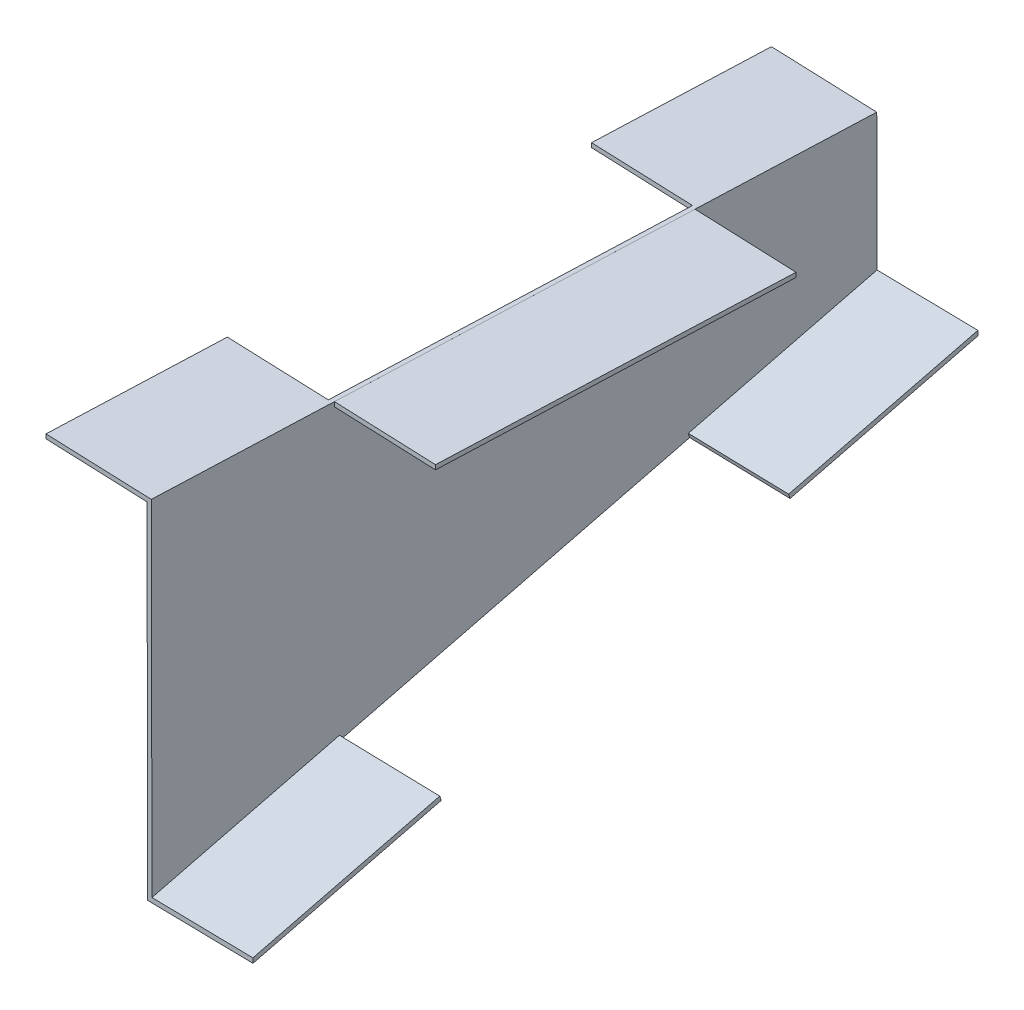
ISO-10303-21;
HEADER;
FILE_DESCRIPTION(('STEP AP214'),'2;1');
FILE_NAME('part.step','',(''),(''),'','','');
FILE_SCHEMA(('AUTOMOTIVE_DESIGN { 1 0 10303 214 1 1 1 1 }'));
ENDSEC;
DATA;
#1=APPLICATION_CONTEXT('core data for automotive mechanical design processes');
#2=APPLICATION_PROTOCOL_DEFINITION('international standard','automotive_design',2000,#1);
#3=PRODUCT_CONTEXT('',#1,'mechanical');
#4=PRODUCT('Part','Part','',(#3));
#5=PRODUCT_RELATED_PRODUCT_CATEGORY('part','',(#4));
#6=PRODUCT_DEFINITION_FORMATION('','',#4);
#7=PRODUCT_DEFINITION_CONTEXT('part definition',#1,'design');
#8=PRODUCT_DEFINITION('design','',#6,#7);
#9=PRODUCT_DEFINITION_SHAPE('','',#8);
#10=(LENGTH_UNIT() NAMED_UNIT(*) SI_UNIT(.MILLI.,.METRE.));
#11=(NAMED_UNIT(*) PLANE_ANGLE_UNIT() SI_UNIT($,.RADIAN.));
#12=(NAMED_UNIT(*) SI_UNIT($,.STERADIAN.) SOLID_ANGLE_UNIT());
#13=UNCERTAINTY_MEASURE_WITH_UNIT(LENGTH_MEASURE(1.E-05),#10,'distance_accuracy_value','');
#14=(GEOMETRIC_REPRESENTATION_CONTEXT(3) GLOBAL_UNCERTAINTY_ASSIGNED_CONTEXT((#13)) GLOBAL_UNIT_ASSIGNED_CONTEXT((#10,
#11,#12)) REPRESENTATION_CONTEXT('',''));
#15=CARTESIAN_POINT('',(0.,0.,0.));
#16=DIRECTION('',(0.,0.,1.));
#17=DIRECTION('',(1.,0.,0.));
#18=AXIS2_PLACEMENT_3D('',#15,#16,#17);
#19=CARTESIAN_POINT('',(44.8063063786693,0.0880080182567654,-1141.75285614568));
#20=DIRECTION('',(0.0392132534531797,7.70222097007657E-05,-0.999230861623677));
#21=DIRECTION('',(-0.999230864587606,0.,-0.0392132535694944));
#22=AXIS2_PLACEMENT_3D('',#19,#20,#21);
#23=PLANE('',#22);
#24=DIRECTION('',(0.9989905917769,0.0219254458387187,0.0392055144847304));
#25=VECTOR('',#24,1.);
#26=CARTESIAN_POINT('',(45.9267992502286,-51.0366664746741,-1141.71282492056));
#27=LINE('',#26,#25);
#28=CARTESIAN_POINT('',(-32.9736635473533,-52.7683422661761,-1144.80928374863));
#29=VERTEX_POINT('',#28);
#30=CARTESIAN_POINT('',(5.08849497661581,-51.9329692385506,-1143.31552943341));
#31=VERTEX_POINT('',#30);
#32=EDGE_CURVE('E932',#29,#31,#27,.T.);
#33=ORIENTED_EDGE('',*,*,#32,.F.);
#34=DIRECTION('',(-0.00196418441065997,0.99999807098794,0.));
#35=VECTOR('',#34,1.);
#36=CARTESIAN_POINT('',(-33.0771828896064,-0.0649698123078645,-1144.80928374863));
#37=LINE('',#36,#35);
#38=CARTESIAN_POINT('',(-32.9736316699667,-52.7845715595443,-1144.80928374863));
#39=VERTEX_POINT('',#38);
#40=EDGE_CURVE('E540',#39,#29,#37,.T.);
#41=ORIENTED_EDGE('',*,*,#40,.F.);
#42=DIRECTION('',(0.999228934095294,0.0019626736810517,0.0392133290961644));
#43=VECTOR('',#42,1.);
#44=CARTESIAN_POINT('',(44.909857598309,-52.6315937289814,-1141.75285614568));
#45=LINE('',#44,#43);
#46=CARTESIAN_POINT('',(-34.597978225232,-52.7877620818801,-1144.8730289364));
#47=VERTEX_POINT('',#46);
#48=EDGE_CURVE('E925',#47,#39,#45,.T.);
#49=ORIENTED_EDGE('',*,*,#48,.F.);
#50=DIRECTION('',(-0.00196418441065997,0.99999807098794,0.));
#51=VECTOR('',#50,1.);
#52=CARTESIAN_POINT('',(-34.7015294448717,-0.0681603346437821,-1144.8730289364));
#53=LINE('',#52,#51);
#54=CARTESIAN_POINT('',(-34.6952773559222,-3.25119999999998,-1144.8730289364));
#55=VERTEX_POINT('',#54);
#56=EDGE_CURVE('E547',#47,#55,#53,.T.);
#57=ORIENTED_EDGE('',*,*,#56,.T.);
#58=DIRECTION('',(0.999230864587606,0.,0.0392132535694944));
#59=VECTOR('',#58,1.);
#60=CARTESIAN_POINT('',(44.8063164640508,-3.25119999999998,-1141.75311314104));
#61=LINE('',#60,#59);
#62=CARTESIAN_POINT('',(-72.769161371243,-3.25119999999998,-1146.3671790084));
#63=VERTEX_POINT('',#62);
#64=EDGE_CURVE('E921',#63,#55,#61,.T.);
#65=ORIENTED_EDGE('',*,*,#64,.F.);
#66=DIRECTION('',(3.02030307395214E-06,-0.99999999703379,-7.69629687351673E-05));
#67=VECTOR('',#66,1.);
#68=CARTESIAN_POINT('',(-72.7691662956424,-1.6207677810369,-1146.3670535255));
#69=LINE('',#68,#67);
#70=CARTESIAN_POINT('',(-72.7691660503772,-1.70197327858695,-1146.36705977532));
#71=VERTEX_POINT('',#70);
#72=EDGE_CURVE('E919',#71,#63,#69,.T.);
#73=ORIENTED_EDGE('',*,*,#72,.F.);
#74=DIRECTION('',(-0.999228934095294,-0.00196267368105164,-0.0392133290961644));
#75=VECTOR('',#74,1.);
#76=CARTESIAN_POINT('',(44.8093686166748,-1.47102690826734,-1141.75285614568));
#77=LINE('',#76,#75);
#78=CARTESIAN_POINT('',(-33.0741206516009,-1.62400473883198,-1144.80928374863));
#79=VERTEX_POINT('',#78);
#80=EDGE_CURVE('E539',#79,#71,#77,.T.);
#81=ORIENTED_EDGE('',*,*,#80,.F.);
#82=CARTESIAN_POINT('',(-32.9769955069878,-51.0719876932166,-1144.80928374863));
#83=VERTEX_POINT('',#82);
#84=EDGE_CURVE('E524',#83,#79,#37,.T.);
#85=ORIENTED_EDGE('',*,*,#84,.F.);
#86=DIRECTION('',(0.9989905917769,0.0219254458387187,0.0392055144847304));
#87=VECTOR('',#86,1.);
#88=CARTESIAN_POINT('',(45.8896367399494,-49.3410544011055,-1141.71415260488));
#89=LINE('',#88,#87);
#90=CARTESIAN_POINT('',(5.05408347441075,-50.2372967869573,-1143.31674915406));
#91=VERTEX_POINT('',#90);
#92=EDGE_CURVE('E537',#83,#91,#89,.T.);
#93=ORIENTED_EDGE('',*,*,#92,.T.);
#94=DIRECTION('',(0.0202895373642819,-0.999793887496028,0.000719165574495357));
#95=VECTOR('',#94,1.);
#96=CARTESIAN_POINT('',(5.0851502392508,-51.7681528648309,-1143.3156479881));
#97=LINE('',#96,#95);
#98=EDGE_CURVE('E545',#91,#31,#97,.T.);
#99=ORIENTED_EDGE('',*,*,#98,.T.);
#100=EDGE_LOOP('',(#33,#41,#49,#57,#65,#73,#81,#85,#93,#99));
#101=FACE_BOUND('',#100,.T.);
#102=ADVANCED_FACE('F343',(#101),#23,.T.);
#103=CARTESIAN_POINT('',(-2.41879427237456,-1.62559999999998,-954.357699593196));
#104=DIRECTION('',(-0.999230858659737,0.,-0.0392134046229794));
#105=DIRECTION('',(-0.0392134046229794,0.,0.999230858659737));
#106=AXIS2_PLACEMENT_3D('',#103,#104,#105);
#107=PLANE('',#106);
#108=DIRECTION('',(0.0392134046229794,0.,-0.999230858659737));
#109=VECTOR('',#108,1.);
#110=CARTESIAN_POINT('',(-2.41879427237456,-3.25119999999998,-954.357699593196));
#111=LINE('',#110,#109);
#112=CARTESIAN_POINT('',(-2.41879427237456,-3.25119999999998,-954.357699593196));
#113=VERTEX_POINT('',#112);
#114=CARTESIAN_POINT('',(2.51150709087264,-3.25119999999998,-1079.99099545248));
#115=VERTEX_POINT('',#114);
#116=EDGE_CURVE('E784',#113,#115,#111,.T.);
#117=ORIENTED_EDGE('',*,*,#116,.T.);
#118=DIRECTION('',(0.,-1.,0.));
#119=VECTOR('',#118,1.);
#120=CARTESIAN_POINT('',(2.51150709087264,-1.62559999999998,-1079.99099545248));
#121=LINE('',#120,#119);
#122=CARTESIAN_POINT('',(2.51150709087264,-1.62559999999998,-1079.99099545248));
#123=VERTEX_POINT('',#122);
#124=EDGE_CURVE('E785',#123,#115,#121,.T.);
#125=ORIENTED_EDGE('',*,*,#124,.F.);
#126=DIRECTION('',(0.0392134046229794,0.,-0.999230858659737));
#127=VECTOR('',#126,1.);
#128=CARTESIAN_POINT('',(-2.41879427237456,-1.62559999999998,-954.357699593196));
#129=LINE('',#128,#127);
#130=CARTESIAN_POINT('',(-2.41879427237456,-1.62559999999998,-954.357699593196));
#131=VERTEX_POINT('',#130);
#132=EDGE_CURVE('E792',#131,#123,#129,.T.);
#133=ORIENTED_EDGE('',*,*,#132,.F.);
#134=DIRECTION('',(0.,-1.,0.));
#135=VECTOR('',#134,1.);
#136=CARTESIAN_POINT('',(-2.41879427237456,-1.62559999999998,-954.357699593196));
#137=LINE('',#136,#135);
#138=EDGE_CURVE('E588',#131,#113,#137,.T.);
#139=ORIENTED_EDGE('',*,*,#138,.T.);
#140=EDGE_LOOP('',(#117,#125,#133,#139));
#141=FACE_BOUND('',#140,.T.);
#142=ADVANCED_FACE('F810',(#141),#107,.F.);
#143=CARTESIAN_POINT('',(-4.70180762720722,-127.371296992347,-890.064538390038));
#144=DIRECTION('',(-0.998795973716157,-0.0203014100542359,-0.0446593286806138));
#145=DIRECTION('',(-0.044668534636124,0.,0.999001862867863));
#146=AXIS2_PLACEMENT_3D('',#143,#144,#145);
#147=PLANE('',#146);
#148=DIRECTION('',(-0.0202895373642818,0.999793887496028,-0.000719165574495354));
#149=VECTOR('',#148,1.);
#150=CARTESIAN_POINT('',(-4.68117552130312,-127.371210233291,-890.526010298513));
#151=LINE('',#150,#149);
#152=CARTESIAN_POINT('',(-4.68396399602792,-127.233804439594,-890.526109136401));
#153=VERTEX_POINT('',#152);
#154=CARTESIAN_POINT('',(-4.71837549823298,-125.538131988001,-890.527328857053));
#155=VERTEX_POINT('',#154);
#156=EDGE_CURVE('E685',#153,#155,#151,.T.);
#157=ORIENTED_EDGE('',*,*,#156,.F.);
#158=DIRECTION('',(-0.0370242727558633,-0.285287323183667,0.95772665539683));
#159=VECTOR('',#158,1.);
#160=CARTESIAN_POINT('',(-4.70180762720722,-127.371296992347,-890.064538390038));
#161=LINE('',#160,#159);
#162=CARTESIAN_POINT('',(-2.146996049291,-107.6854179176,-956.151215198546));
#163=VERTEX_POINT('',#162);
#164=EDGE_CURVE('E730',#163,#153,#161,.T.);
#165=ORIENTED_EDGE('',*,*,#164,.F.);
#166=DIRECTION('',(-0.0321839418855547,0.95822700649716,0.28419218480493));
#167=VECTOR('',#166,1.);
#168=CARTESIAN_POINT('',(-2.146996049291,-107.6854179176,-956.151215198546));
#169=LINE('',#168,#167);
#170=CARTESIAN_POINT('',(-2.19931426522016,-106.127724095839,-955.689232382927));
#171=VERTEX_POINT('',#170);
#172=EDGE_CURVE('E732',#163,#171,#169,.T.);
#173=ORIENTED_EDGE('',*,*,#172,.T.);
#174=DIRECTION('',(-0.0370242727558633,-0.285287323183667,0.95772665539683));
#175=VECTOR('',#174,1.);
#176=CARTESIAN_POINT('',(-4.75412584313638,-125.813603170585,-889.602555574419));
#177=LINE('',#176,#175);
#178=EDGE_CURVE('E729',#171,#155,#177,.T.);
#179=ORIENTED_EDGE('',*,*,#178,.T.);
#180=EDGE_LOOP('',(#157,#165,#173,#179));
#181=FACE_BOUND('',#180,.T.);
#182=ADVANCED_FACE('F833',(#181),#147,.F.);
#183=CARTESIAN_POINT('',(-75.2241274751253,-73.3962182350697,-1080.04183992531));
#184=DIRECTION('',(0.998795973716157,0.0203014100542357,0.0446593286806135));
#185=DIRECTION('',(0.0446685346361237,0.,-0.999001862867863));
#186=AXIS2_PLACEMENT_3D('',#183,#184,#185);
#187=PLANE('',#186);
#188=DIRECTION('',(0.037024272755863,0.285287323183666,-0.95772665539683));
#189=VECTOR('',#188,1.);
#190=CARTESIAN_POINT('',(-75.2480951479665,-72.6826179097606,-1079.83019943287));
#191=LINE('',#190,#189);
#192=CARTESIAN_POINT('',(-79.8561361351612,-108.1894781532,-960.631539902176));
#193=VERTEX_POINT('',#192);
#194=CARTESIAN_POINT('',(-75.2480951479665,-72.6826179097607,-1079.83019943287));
#195=VERTEX_POINT('',#194);
#196=EDGE_CURVE('E575',#193,#195,#191,.T.);
#197=ORIENTED_EDGE('',*,*,#196,.F.);
#198=DIRECTION('',(-0.0321839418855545,0.95822700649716,0.284192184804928));
#199=VECTOR('',#198,1.);
#200=CARTESIAN_POINT('',(-79.8321684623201,-108.903078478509,-960.843180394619));
#201=LINE('',#200,#199);
#202=CARTESIAN_POINT('',(-79.8844866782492,-107.345384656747,-960.381197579));
#203=VERTEX_POINT('',#202);
#204=EDGE_CURVE('E587',#193,#203,#201,.T.);
#205=ORIENTED_EDGE('',*,*,#204,.T.);
#206=DIRECTION('',(0.037024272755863,0.285287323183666,-0.95772665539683));
#207=VECTOR('',#206,1.);
#208=CARTESIAN_POINT('',(-75.2764456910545,-71.8385244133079,-1079.57985710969));
#209=LINE('',#208,#207);
#210=CARTESIAN_POINT('',(-75.2764456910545,-71.8385244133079,-1079.57985710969));
#211=VERTEX_POINT('',#210);
#212=EDGE_CURVE('E595',#203,#211,#209,.T.);
#213=ORIENTED_EDGE('',*,*,#212,.T.);
#214=DIRECTION('',(-0.0321839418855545,0.95822700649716,0.284192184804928));
#215=VECTOR('',#214,1.);
#216=CARTESIAN_POINT('',(-75.2241274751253,-73.3962182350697,-1080.04183992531));
#217=LINE('',#216,#215);
#218=EDGE_CURVE('E598',#195,#211,#217,.T.);
#219=ORIENTED_EDGE('',*,*,#218,.F.);
#220=EDGE_LOOP('',(#197,#205,#213,#219));
#221=FACE_BOUND('',#220,.T.);
#222=ADVANCED_FACE('F840',(#221),#187,.F.);
#223=CARTESIAN_POINT('',(12.0641081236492,-359.190128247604,-106.529065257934));
#224=DIRECTION('',(0.0321839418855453,-0.95822700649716,-0.284192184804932));
#225=DIRECTION('',(0.,0.284339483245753,-0.958723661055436));
#226=AXIS2_PLACEMENT_3D('',#223,#224,#225);
#227=PLANE('',#226);
#228=ORIENTED_EDGE('',*,*,#164,.T.);
#229=DIRECTION('',(-0.9989905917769,-0.0219254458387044,-0.0392055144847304));
#230=VECTOR('',#229,1.);
#231=CARTESIAN_POINT('',(37.6556829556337,-126.304550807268,-888.864484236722));
#232=LINE('',#231,#230);
#233=CARTESIAN_POINT('',(-42.746122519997,-128.069177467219,-892.019863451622));
#234=VERTEX_POINT('',#233);
#235=EDGE_CURVE('E692',#153,#234,#232,.T.);
#236=ORIENTED_EDGE('',*,*,#235,.T.);
#237=DIRECTION('',(0.0370242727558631,0.285287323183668,-0.957726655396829));
#238=VECTOR('',#237,1.);
#239=CARTESIAN_POINT('',(-72.9650393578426,-360.918420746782,-110.330987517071));
#240=LINE('',#239,#238);
#241=CARTESIAN_POINT('',(-40.2011226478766,-108.458901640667,-957.852735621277));
#242=VERTEX_POINT('',#241);
#243=EDGE_CURVE('E646',#234,#242,#240,.T.);
#244=ORIENTED_EDGE('',*,*,#243,.T.);
#245=DIRECTION('',(0.998795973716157,0.0203014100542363,0.0446593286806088));
#246=VECTOR('',#245,1.);
#247=CARTESIAN_POINT('',(-2.146996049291,-107.6854179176,-956.151215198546));
#248=LINE('',#247,#246);
#249=EDGE_CURVE('E554',#242,#163,#248,.T.);
#250=ORIENTED_EDGE('',*,*,#249,.T.);
#251=EDGE_LOOP('',(#228,#236,#244,#250));
#252=FACE_BOUND('',#251,.T.);
#253=ADVANCED_FACE('F853',(#252),#227,.T.);
#254=CARTESIAN_POINT('',(-2.146996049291,-107.6854179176,-956.151215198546));
#255=DIRECTION('',(-0.0370242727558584,-0.285287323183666,0.95772665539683));
#256=DIRECTION('',(0.,-0.958383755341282,-0.285483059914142));
#257=AXIS2_PLACEMENT_3D('',#254,#255,#256);
#258=PLANE('',#257);
#259=DIRECTION('',(0.0130667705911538,-0.958440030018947,-0.284994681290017));
#260=VECTOR('',#259,1.);
#261=CARTESIAN_POINT('',(-45.1195725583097,252.30654127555,-850.578175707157));
#262=LINE('',#261,#260);
#263=CARTESIAN_POINT('',(-40.2223678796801,-106.900576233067,-957.389363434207));
#264=VERTEX_POINT('',#263);
#265=EDGE_CURVE('E531',#264,#242,#262,.T.);
#266=ORIENTED_EDGE('',*,*,#265,.F.);
#267=DIRECTION('',(0.998795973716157,0.0203014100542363,0.0446593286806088));
#268=VECTOR('',#267,1.);
#269=CARTESIAN_POINT('',(-2.19931426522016,-106.127724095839,-955.689232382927));
#270=LINE('',#269,#268);
#271=EDGE_CURVE('E640',#264,#171,#270,.T.);
#272=ORIENTED_EDGE('',*,*,#271,.T.);
#273=ORIENTED_EDGE('',*,*,#172,.F.);
#274=ORIENTED_EDGE('',*,*,#249,.F.);
#275=EDGE_LOOP('',(#266,#272,#273,#274));
#276=FACE_BOUND('',#275,.T.);
#277=ADVANCED_FACE('F724',(#276),#258,.F.);
#278=CARTESIAN_POINT('',(12.01178990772,-357.632434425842,-106.067082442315));
#279=DIRECTION('',(0.0321839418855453,-0.95822700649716,-0.284192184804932));
#280=DIRECTION('',(0.,0.284339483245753,-0.958723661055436));
#281=AXIS2_PLACEMENT_3D('',#278,#279,#280);
#282=PLANE('',#281);
#283=DIRECTION('',(-0.9989905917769,-0.0219254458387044,-0.0392055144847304));
#284=VECTOR('',#283,1.);
#285=CARTESIAN_POINT('',(37.6185204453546,-124.608938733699,-888.865811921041));
#286=LINE('',#285,#284);
#287=CARTESIAN_POINT('',(-42.7494544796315,-126.37282289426,-892.019863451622));
#288=VERTEX_POINT('',#287);
#289=EDGE_CURVE('E352',#155,#288,#286,.T.);
#290=ORIENTED_EDGE('',*,*,#289,.F.);
#291=ORIENTED_EDGE('',*,*,#178,.F.);
#292=ORIENTED_EDGE('',*,*,#271,.F.);
#293=DIRECTION('',(0.0370242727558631,0.285287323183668,-0.957726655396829));
#294=VECTOR('',#293,1.);
#295=CARTESIAN_POINT('',(-72.9862845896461,-359.360095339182,-109.867615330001));
#296=LINE('',#295,#294);
#297=EDGE_CURVE('E651',#288,#264,#296,.T.);
#298=ORIENTED_EDGE('',*,*,#297,.F.);
#299=EDGE_LOOP('',(#290,#291,#292,#298));
#300=FACE_BOUND('',#299,.T.);
#301=ADVANCED_FACE('F728',(#300),#282,.F.);
#302=CARTESIAN_POINT('',(-35.5591886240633,-1.62559999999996,-1081.48502616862));
#303=DIRECTION('',(-0.0392134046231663,0.,0.999230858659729));
#304=DIRECTION('',(0.999230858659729,0.,0.0392134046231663));
#305=AXIS2_PLACEMENT_3D('',#302,#303,#304);
#306=PLANE('',#305);
#307=DIRECTION('',(0.001961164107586,-0.999998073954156,7.69631171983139E-05));
#308=VECTOR('',#307,1.);
#309=CARTESIAN_POINT('',(-35.5620766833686,-0.152977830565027,-1081.48513950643));
#310=LINE('',#309,#308);
#311=CARTESIAN_POINT('',(-35.5591886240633,-1.62559999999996,-1081.48502616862));
#312=VERTEX_POINT('',#311);
#313=CARTESIAN_POINT('',(-35.5560005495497,-3.25119999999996,-1081.48490105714));
#314=VERTEX_POINT('',#313);
#315=EDGE_CURVE('E768',#312,#314,#310,.T.);
#316=ORIENTED_EDGE('',*,*,#315,.F.);
#317=DIRECTION('',(-0.999230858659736,0.,-0.0392134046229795));
#318=VECTOR('',#317,1.);
#319=CARTESIAN_POINT('',(2.51150709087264,-1.62559999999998,-1079.99099545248));
#320=LINE('',#319,#318);
#321=EDGE_CURVE('E781',#123,#312,#320,.T.);
#322=ORIENTED_EDGE('',*,*,#321,.F.);
#323=ORIENTED_EDGE('',*,*,#124,.T.);
#324=DIRECTION('',(-0.999230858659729,0.,-0.0392134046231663));
#325=VECTOR('',#324,1.);
#326=CARTESIAN_POINT('',(-35.5591886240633,-3.25119999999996,-1081.48502616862));
#327=LINE('',#326,#325);
#328=EDGE_CURVE('E774',#115,#314,#327,.T.);
#329=ORIENTED_EDGE('',*,*,#328,.T.);
#330=EDGE_LOOP('',(#316,#322,#323,#329));
#331=FACE_BOUND('',#330,.T.);
#332=ADVANCED_FACE('F808',(#331),#306,.F.);
#333=CARTESIAN_POINT('',(0.,-1.62559999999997,0.));
#334=DIRECTION('',(0.,-1.,0.));
#335=DIRECTION('',(0.,0.,-1.));
#336=AXIS2_PLACEMENT_3D('',#333,#334,#335);
#337=PLANE('',#336);
#338=DIRECTION('',(0.0392134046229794,0.,-0.999230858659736));
#339=VECTOR('',#338,1.);
#340=CARTESIAN_POINT('',(-77.8806012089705,-1.62559999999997,-3.05631426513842));
#341=LINE('',#340,#339);
#342=CARTESIAN_POINT('',(-40.4894899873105,-1.62559999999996,-955.851730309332));
#343=VERTEX_POINT('',#342);
#344=EDGE_CURVE('E758',#343,#312,#341,.T.);
#345=ORIENTED_EDGE('',*,*,#344,.F.);
#346=DIRECTION('',(0.999230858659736,0.,0.0392134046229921));
#347=VECTOR('',#346,1.);
#348=CARTESIAN_POINT('',(-41.7585131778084,-1.62559999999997,-955.901531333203));
#349=LINE('',#348,#347);
#350=EDGE_CURVE('E772',#343,#131,#349,.T.);
#351=ORIENTED_EDGE('',*,*,#350,.T.);
#352=ORIENTED_EDGE('',*,*,#132,.T.);
#353=ORIENTED_EDGE('',*,*,#321,.T.);
#354=EDGE_LOOP('',(#345,#351,#352,#353));
#355=FACE_BOUND('',#354,.T.);
#356=ADVANCED_FACE('F820',(#355),#337,.F.);
#357=CARTESIAN_POINT('',(-2.41879427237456,-1.62559999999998,-954.357699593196));
#358=DIRECTION('',(0.0392134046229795,0.,-0.999230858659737));
#359=DIRECTION('',(-0.999230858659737,0.,-0.0392134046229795));
#360=AXIS2_PLACEMENT_3D('',#357,#358,#359);
#361=PLANE('',#360);
#362=DIRECTION('',(-0.00196116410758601,0.999998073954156,-7.69631171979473E-05));
#363=VECTOR('',#362,1.);
#364=CARTESIAN_POINT('',(-40.4923780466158,-0.152977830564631,-955.851843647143));
#365=LINE('',#364,#363);
#366=CARTESIAN_POINT('',(-40.4863019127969,-3.25119999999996,-955.851605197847));
#367=VERTEX_POINT('',#366);
#368=EDGE_CURVE('E763',#367,#343,#365,.T.);
#369=ORIENTED_EDGE('',*,*,#368,.F.);
#370=DIRECTION('',(0.999230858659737,0.,0.0392134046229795));
#371=VECTOR('',#370,1.);
#372=CARTESIAN_POINT('',(-2.41879427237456,-3.25119999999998,-954.357699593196));
#373=LINE('',#372,#371);
#374=EDGE_CURVE('E586',#367,#113,#373,.T.);
#375=ORIENTED_EDGE('',*,*,#374,.T.);
#376=ORIENTED_EDGE('',*,*,#138,.F.);
#377=ORIENTED_EDGE('',*,*,#350,.F.);
#378=EDGE_LOOP('',(#369,#375,#376,#377));
#379=FACE_BOUND('',#378,.T.);
#380=ADVANCED_FACE('F819',(#379),#361,.F.);
#381=CARTESIAN_POINT('',(0.,-3.25119999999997,0.));
#382=DIRECTION('',(0.,-1.,0.));
#383=DIRECTION('',(0.,0.,-1.));
#384=AXIS2_PLACEMENT_3D('',#381,#382,#383);
#385=PLANE('',#384);
#386=ORIENTED_EDGE('',*,*,#374,.F.);
#387=DIRECTION('',(0.0392134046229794,0.,-0.999230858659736));
#388=VECTOR('',#387,1.);
#389=CARTESIAN_POINT('',(-77.8774131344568,-3.25119999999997,-3.05618915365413));
#390=LINE('',#389,#388);
#391=EDGE_CURVE('E647',#367,#314,#390,.T.);
#392=ORIENTED_EDGE('',*,*,#391,.T.);
#393=ORIENTED_EDGE('',*,*,#328,.F.);
#394=ORIENTED_EDGE('',*,*,#116,.F.);
#395=EDGE_LOOP('',(#386,#392,#393,#394));
#396=FACE_BOUND('',#395,.T.);
#397=ADVANCED_FACE('F816',(#396),#385,.T.);
#398=CARTESIAN_POINT('',(-82.6994902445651,-1.62559999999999,-893.323834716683));
#399=DIRECTION('',(-0.999230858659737,0.,-0.0392134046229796));
#400=DIRECTION('',(-0.0392134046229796,0.,0.999230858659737));
#401=AXIS2_PLACEMENT_3D('',#398,#399,#400);
#402=PLANE('',#401);
#403=DIRECTION('',(0.0392134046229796,0.,-0.999230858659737));
#404=VECTOR('',#403,1.);
#405=CARTESIAN_POINT('',(-82.6994902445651,-3.25119999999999,-893.323834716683));
#406=LINE('',#405,#404);
#407=CARTESIAN_POINT('',(-82.6895253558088,-3.25119999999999,-893.577758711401));
#408=VERTEX_POINT('',#407);
#409=CARTESIAN_POINT('',(-80.2094390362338,-3.25119999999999,-956.774994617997));
#410=VERTEX_POINT('',#409);
#411=EDGE_CURVE('E605',#408,#410,#406,.T.);
#412=ORIENTED_EDGE('',*,*,#411,.F.);
#413=DIRECTION('',(-3.02030307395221E-06,0.99999999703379,7.69629687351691E-05));
#414=VECTOR('',#413,1.);
#415=CARTESIAN_POINT('',(-82.6895302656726,-1.62558043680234,-893.577633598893));
#416=LINE('',#415,#414);
#417=CARTESIAN_POINT('',(-82.6895300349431,-1.70197327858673,-893.577639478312));
#418=VERTEX_POINT('',#417);
#419=EDGE_CURVE('E690',#408,#418,#416,.T.);
#420=ORIENTED_EDGE('',*,*,#419,.T.);
#421=DIRECTION('',(0.0392134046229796,0.,-0.999230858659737));
#422=VECTOR('',#421,1.);
#423=CARTESIAN_POINT('',(-82.6994902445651,-1.70197327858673,-893.323834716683));
#424=LINE('',#423,#422);
#425=CARTESIAN_POINT('',(-80.2094390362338,-1.70197327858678,-956.774994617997));
#426=VERTEX_POINT('',#425);
#427=EDGE_CURVE('E626',#418,#426,#424,.T.);
#428=ORIENTED_EDGE('',*,*,#427,.T.);
#429=DIRECTION('',(0.,-1.,0.));
#430=VECTOR('',#429,1.);
#431=CARTESIAN_POINT('',(-80.2094390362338,-1.62559999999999,-956.774994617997));
#432=LINE('',#431,#430);
#433=EDGE_CURVE('E601',#426,#410,#432,.T.);
#434=ORIENTED_EDGE('',*,*,#433,.T.);
#435=EDGE_LOOP('',(#412,#420,#428,#434));
#436=FACE_BOUND('',#435,.T.);
#437=ADVANCED_FACE('F850',(#436),#402,.T.);
#438=CARTESIAN_POINT('',(-35.499040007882,-72.2274115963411,-1079.48402085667));
#439=DIRECTION('',(0.0370242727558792,0.285287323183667,-0.957726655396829));
#440=DIRECTION('',(0.,0.958383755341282,0.285483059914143));
#441=AXIS2_PLACEMENT_3D('',#438,#439,#440);
#442=PLANE('',#441);
#443=DIRECTION('',(-0.0130667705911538,0.958440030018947,0.284994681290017));
#444=VECTOR('',#443,1.);
#445=CARTESIAN_POINT('',(-40.4174899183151,288.538031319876,-972.209460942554));
#446=LINE('',#445,#444);
#447=CARTESIAN_POINT('',(-35.499040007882,-72.2274115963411,-1079.48402085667));
#448=VERTEX_POINT('',#447);
#449=CARTESIAN_POINT('',(-35.5202852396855,-70.669086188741,-1079.0206486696));
#450=VERTEX_POINT('',#449);
#451=EDGE_CURVE('E527',#448,#450,#446,.T.);
#452=ORIENTED_EDGE('',*,*,#451,.F.);
#453=DIRECTION('',(-0.998795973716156,-0.0203014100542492,-0.0446593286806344));
#454=VECTOR('',#453,1.);
#455=CARTESIAN_POINT('',(-35.499040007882,-72.2274115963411,-1079.48402085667));
#456=LINE('',#455,#454);
#457=CARTESIAN_POINT('',(2.55508659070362,-71.4539278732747,-1077.78250043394));
#458=VERTEX_POINT('',#457);
#459=EDGE_CURVE('E751',#458,#448,#456,.T.);
#460=ORIENTED_EDGE('',*,*,#459,.F.);
#461=DIRECTION('',(-0.0321839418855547,0.95822700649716,0.28419218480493));
#462=VECTOR('',#461,1.);
#463=CARTESIAN_POINT('',(2.55508659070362,-71.4539278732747,-1077.78250043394));
#464=LINE('',#463,#462);
#465=CARTESIAN_POINT('',(2.50276837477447,-69.8962340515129,-1077.32051761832));
#466=VERTEX_POINT('',#465);
#467=EDGE_CURVE('E741',#458,#466,#464,.T.);
#468=ORIENTED_EDGE('',*,*,#467,.T.);
#469=DIRECTION('',(-0.998795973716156,-0.0203014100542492,-0.0446593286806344));
#470=VECTOR('',#469,1.);
#471=CARTESIAN_POINT('',(-35.5513582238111,-70.6697177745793,-1079.02203804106));
#472=LINE('',#471,#470);
#473=EDGE_CURVE('E755',#466,#450,#472,.T.);
#474=ORIENTED_EDGE('',*,*,#473,.T.);
#475=EDGE_LOOP('',(#452,#460,#468,#474));
#476=FACE_BOUND('',#475,.T.);
#477=ADVANCED_FACE('F854',(#476),#442,.F.);
#478=CARTESIAN_POINT('',(5.10989816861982,-51.7680487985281,-1143.86917724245));
#479=DIRECTION('',(-0.998795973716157,-0.0203014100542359,-0.0446593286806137));
#480=DIRECTION('',(-0.0446685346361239,0.,0.999001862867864));
#481=AXIS2_PLACEMENT_3D('',#478,#479,#480);
#482=PLANE('',#481);
#483=ORIENTED_EDGE('',*,*,#98,.F.);
#484=DIRECTION('',(-0.0370242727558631,-0.285287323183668,0.957726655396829));
#485=VECTOR('',#484,1.);
#486=CARTESIAN_POINT('',(5.05757995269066,-50.2103549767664,-1143.40719442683));
#487=LINE('',#486,#485);
#488=EDGE_CURVE('E543',#91,#466,#487,.T.);
#489=ORIENTED_EDGE('',*,*,#488,.T.);
#490=ORIENTED_EDGE('',*,*,#467,.F.);
#491=DIRECTION('',(-0.0370242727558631,-0.285287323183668,0.957726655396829));
#492=VECTOR('',#491,1.);
#493=CARTESIAN_POINT('',(5.10989816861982,-51.7680487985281,-1143.86917724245));
#494=LINE('',#493,#492);
#495=EDGE_CURVE('E740',#31,#458,#494,.T.);
#496=ORIENTED_EDGE('',*,*,#495,.F.);
#497=EDGE_LOOP('',(#483,#489,#490,#496));
#498=FACE_BOUND('',#497,.T.);
#499=ADVANCED_FACE('F857',(#498),#482,.F.);
#500=CARTESIAN_POINT('',(-77.8834892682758,-0.15297783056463,-3.05642760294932));
#501=DIRECTION('',(0.999228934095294,0.00196267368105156,0.0392133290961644));
#502=DIRECTION('',(0.0392134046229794,0.,-0.999230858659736));
#503=AXIS2_PLACEMENT_3D('',#500,#501,#502);
#504=PLANE('',#503);
#505=ORIENTED_EDGE('',*,*,#391,.F.);
#506=ORIENTED_EDGE('',*,*,#368,.T.);
#507=ORIENTED_EDGE('',*,*,#344,.T.);
#508=ORIENTED_EDGE('',*,*,#315,.T.);
#509=EDGE_LOOP('',(#505,#506,#507,#508));
#510=FACE_BOUND('',#509,.T.);
#511=DIRECTION('',(0.0370242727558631,0.285287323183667,-0.95772665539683));
#512=VECTOR('',#511,1.);
#513=CARTESIAN_POINT('',(-42.7559023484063,-128.161010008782,-891.766058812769));
#514=LINE('',#513,#512);
#515=CARTESIAN_POINT('',(-42.7460906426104,-128.085406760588,-892.019863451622));
#516=VERTEX_POINT('',#515);
#517=EDGE_CURVE('E553',#516,#39,#514,.T.);
#518=ORIENTED_EDGE('',*,*,#517,.T.);
#519=ORIENTED_EDGE('',*,*,#40,.T.);
#520=DIRECTION('',(0.0370242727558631,0.285287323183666,-0.95772665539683));
#521=VECTOR('',#520,1.);
#522=CARTESIAN_POINT('',(-72.9650393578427,-360.918420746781,-110.330987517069));
#523=LINE('',#522,#521);
#524=EDGE_CURVE('E532',#448,#29,#523,.T.);
#525=ORIENTED_EDGE('',*,*,#524,.F.);
#526=ORIENTED_EDGE('',*,*,#451,.T.);
#527=DIRECTION('',(0.0370242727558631,0.285287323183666,-0.95772665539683));
#528=VECTOR('',#527,1.);
#529=CARTESIAN_POINT('',(-72.9862845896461,-359.360095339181,-109.867615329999));
#530=LINE('',#529,#528);
#531=EDGE_CURVE('E520',#450,#83,#530,.T.);
#532=ORIENTED_EDGE('',*,*,#531,.T.);
#533=ORIENTED_EDGE('',*,*,#84,.T.);
#534=DIRECTION('',(-0.0392134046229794,0.,0.999230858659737));
#535=VECTOR('',#534,1.);
#536=CARTESIAN_POINT('',(-33.0442400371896,-1.62400473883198,-1145.57069766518));
#537=LINE('',#536,#535);
#538=CARTESIAN_POINT('',(-42.9944846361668,-1.62400473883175,-892.019863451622));
#539=VERTEX_POINT('',#538);
#540=EDGE_CURVE('E551',#79,#539,#537,.T.);
#541=ORIENTED_EDGE('',*,*,#540,.T.);
#542=DIRECTION('',(0.00196418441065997,-0.99999807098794,0.));
#543=VECTOR('',#542,1.);
#544=CARTESIAN_POINT('',(-42.9975086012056,-0.0844551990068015,-892.019863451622));
#545=LINE('',#544,#543);
#546=EDGE_CURVE('E695',#539,#288,#545,.T.);
#547=ORIENTED_EDGE('',*,*,#546,.T.);
#548=ORIENTED_EDGE('',*,*,#297,.T.);
#549=ORIENTED_EDGE('',*,*,#265,.T.);
#550=ORIENTED_EDGE('',*,*,#243,.F.);
#551=EDGE_CURVE('E697',#234,#516,#545,.T.);
#552=ORIENTED_EDGE('',*,*,#551,.T.);
#553=EDGE_LOOP('',(#518,#519,#525,#526,#532,#533,#541,#547,#548,#549,#550,#552));
#554=FACE_BOUND('',#553,.T.);
#555=ADVANCED_FACE('F523',(#510,#554),#504,.T.);
#556=CARTESIAN_POINT('',(12.0641081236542,-359.190128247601,-106.529065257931));
#557=DIRECTION('',(0.0321839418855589,-0.95822700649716,-0.284192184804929));
#558=DIRECTION('',(0.,0.28433948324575,-0.958723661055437));
#559=AXIS2_PLACEMENT_3D('',#556,#557,#558);
#560=PLANE('',#559);
#561=ORIENTED_EDGE('',*,*,#524,.T.);
#562=ORIENTED_EDGE('',*,*,#32,.T.);
#563=ORIENTED_EDGE('',*,*,#495,.T.);
#564=ORIENTED_EDGE('',*,*,#459,.T.);
#565=EDGE_LOOP('',(#561,#562,#563,#564));
#566=FACE_BOUND('',#565,.T.);
#567=ADVANCED_FACE('F872',(#566),#560,.T.);
#568=CARTESIAN_POINT('',(12.011789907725,-357.632434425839,-106.067082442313));
#569=DIRECTION('',(0.0321839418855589,-0.95822700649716,-0.284192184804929));
#570=DIRECTION('',(0.,0.28433948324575,-0.958723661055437));
#571=AXIS2_PLACEMENT_3D('',#568,#569,#570);
#572=PLANE('',#571);
#573=ORIENTED_EDGE('',*,*,#92,.F.);
#574=ORIENTED_EDGE('',*,*,#531,.F.);
#575=ORIENTED_EDGE('',*,*,#473,.F.);
#576=ORIENTED_EDGE('',*,*,#488,.F.);
#577=EDGE_LOOP('',(#573,#574,#575,#576));
#578=FACE_BOUND('',#577,.T.);
#579=ADVANCED_FACE('F542',(#578),#572,.F.);
#580=CARTESIAN_POINT('',(-40.6159154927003,-1.62559999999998,-955.221202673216));
#581=DIRECTION('',(0.0392134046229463,0.,-0.999230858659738));
#582=DIRECTION('',(-0.999230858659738,0.,-0.0392134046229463));
#583=AXIS2_PLACEMENT_3D('',#580,#581,#582);
#584=PLANE('',#583);
#585=ORIENTED_EDGE('',*,*,#433,.F.);
#586=DIRECTION('',(0.999228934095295,0.00196267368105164,0.0392133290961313));
#587=VECTOR('',#586,1.);
#588=CARTESIAN_POINT('',(-40.6159182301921,-1.62420415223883,-955.221202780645));
#589=LINE('',#588,#587);
#590=CARTESIAN_POINT('',(-42.1387401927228,-1.62719526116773,-955.280963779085));
#591=VERTEX_POINT('',#590);
#592=EDGE_CURVE('E565',#426,#591,#589,.T.);
#593=ORIENTED_EDGE('',*,*,#592,.T.);
#594=DIRECTION('',(-0.00196116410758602,0.999998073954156,-7.69631171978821E-05));
#595=VECTOR('',#594,1.);
#596=CARTESIAN_POINT('',(-42.1416251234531,-0.156168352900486,-955.281076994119));
#597=LINE('',#596,#595);
#598=CARTESIAN_POINT('',(-42.1355552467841,-3.25119999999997,-955.280838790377));
#599=VERTEX_POINT('',#598);
#600=EDGE_CURVE('E662',#599,#591,#597,.T.);
#601=ORIENTED_EDGE('',*,*,#600,.F.);
#602=DIRECTION('',(0.999230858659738,0.,0.0392134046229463));
#603=VECTOR('',#602,1.);
#604=CARTESIAN_POINT('',(-40.6159154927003,-3.25119999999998,-955.221202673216));
#605=LINE('',#604,#603);
#606=EDGE_CURVE('E581',#410,#599,#605,.T.);
#607=ORIENTED_EDGE('',*,*,#606,.F.);
#608=EDGE_LOOP('',(#585,#593,#601,#607));
#609=FACE_BOUND('',#608,.T.);
#610=ADVANCED_FACE('F892',(#609),#584,.T.);
#611=CARTESIAN_POINT('',(0.,-3.25119999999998,0.));
#612=DIRECTION('',(0.,-1.,0.));
#613=DIRECTION('',(0.,0.,-1.));
#614=AXIS2_PLACEMENT_3D('',#611,#612,#613);
#615=PLANE('',#614);
#616=DIRECTION('',(0.0392134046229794,0.,-0.999230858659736));
#617=VECTOR('',#616,1.);
#618=CARTESIAN_POINT('',(-79.5017659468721,-3.25119999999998,-3.11993458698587));
#619=LINE('',#618,#617);
#620=CARTESIAN_POINT('',(-44.615641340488,-3.25119999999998,-892.083608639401));
#621=VERTEX_POINT('',#620);
#622=EDGE_CURVE('E368',#621,#599,#619,.T.);
#623=ORIENTED_EDGE('',*,*,#622,.F.);
#624=DIRECTION('',(-0.999230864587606,0.,-0.0392132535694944));
#625=VECTOR('',#624,1.);
#626=CARTESIAN_POINT('',(34.8859906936,-3.25119999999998,-888.963691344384));
#627=LINE('',#626,#625);
#628=EDGE_CURVE('E632',#621,#408,#627,.T.);
#629=ORIENTED_EDGE('',*,*,#628,.T.);
#630=ORIENTED_EDGE('',*,*,#411,.T.);
#631=ORIENTED_EDGE('',*,*,#606,.T.);
#632=EDGE_LOOP('',(#623,#629,#630,#631));
#633=FACE_BOUND('',#632,.T.);
#634=ADVANCED_FACE('F896',(#633),#615,.T.);
#635=CARTESIAN_POINT('',(34.8859806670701,0.0685226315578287,-888.963435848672));
#636=DIRECTION('',(-0.0392132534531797,-7.70222097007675E-05,0.999230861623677));
#637=DIRECTION('',(0.999230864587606,0.,0.0392132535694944));
#638=AXIS2_PLACEMENT_3D('',#635,#636,#637);
#639=PLANE('',#638);
#640=ORIENTED_EDGE('',*,*,#235,.F.);
#641=ORIENTED_EDGE('',*,*,#156,.T.);
#642=ORIENTED_EDGE('',*,*,#289,.T.);
#643=ORIENTED_EDGE('',*,*,#546,.F.);
#644=DIRECTION('',(0.999228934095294,0.00196267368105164,0.0392133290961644));
#645=VECTOR('',#644,1.);
#646=CARTESIAN_POINT('',(34.889004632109,-1.47102690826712,-888.963435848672));
#647=LINE('',#646,#645);
#648=EDGE_CURVE('E698',#418,#539,#647,.T.);
#649=ORIENTED_EDGE('',*,*,#648,.F.);
#650=ORIENTED_EDGE('',*,*,#419,.F.);
#651=ORIENTED_EDGE('',*,*,#628,.F.);
#652=DIRECTION('',(0.00196418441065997,-0.99999807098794,0.));
#653=VECTOR('',#652,1.);
#654=CARTESIAN_POINT('',(-44.6218551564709,-0.0876457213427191,-892.0836086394));
#655=LINE('',#654,#653);
#656=CARTESIAN_POINT('',(-44.3704371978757,-128.088597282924,-892.0836086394));
#657=VERTEX_POINT('',#656);
#658=EDGE_CURVE('E12',#621,#657,#655,.T.);
#659=ORIENTED_EDGE('',*,*,#658,.T.);
#660=DIRECTION('',(-0.999228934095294,-0.0019626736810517,-0.0392133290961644));
#661=VECTOR('',#660,1.);
#662=CARTESIAN_POINT('',(35.1373986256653,-127.932428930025,-888.963435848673));
#663=LINE('',#662,#661);
#664=EDGE_CURVE('E688',#516,#657,#663,.T.);
#665=ORIENTED_EDGE('',*,*,#664,.F.);
#666=ORIENTED_EDGE('',*,*,#551,.F.);
#667=EDGE_LOOP('',(#640,#641,#642,#643,#649,#650,#651,#659,#665,#666));
#668=FACE_BOUND('',#667,.T.);
#669=ADVANCED_FACE('F864',(#668),#639,.T.);
#670=CARTESIAN_POINT('',(-79.8321684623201,-108.903078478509,-960.843180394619));
#671=DIRECTION('',(0.037024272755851,0.285287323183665,-0.957726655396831));
#672=DIRECTION('',(0.,0.958383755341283,0.285483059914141));
#673=AXIS2_PLACEMENT_3D('',#670,#671,#672);
#674=PLANE('',#673);
#675=DIRECTION('',(-0.999228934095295,-0.00196267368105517,-0.0392133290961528));
#676=VECTOR('',#675,1.);
#677=CARTESIAN_POINT('',(-79.841897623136,-108.189450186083,-960.63098113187));
#678=LINE('',#677,#676);
#679=CARTESIAN_POINT('',(-41.7782451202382,-108.114686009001,-959.137226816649));
#680=VERTEX_POINT('',#679);
#681=EDGE_CURVE('E934',#680,#193,#678,.T.);
#682=ORIENTED_EDGE('',*,*,#681,.F.);
#683=DIRECTION('',(-0.0130667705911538,0.958440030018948,0.284994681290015));
#684=VECTOR('',#683,1.);
#685=CARTESIAN_POINT('',(-46.696898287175,252.665665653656,-851.85823374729));
#686=LINE('',#685,#684);
#687=CARTESIAN_POINT('',(-41.7992870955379,-106.571269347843,-958.678287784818));
#688=VERTEX_POINT('',#687);
#689=EDGE_CURVE('E665',#680,#688,#686,.T.);
#690=ORIENTED_EDGE('',*,*,#689,.T.);
#691=DIRECTION('',(-0.998795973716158,-0.020301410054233,-0.0446593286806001));
#692=VECTOR('',#691,1.);
#693=CARTESIAN_POINT('',(-79.8844866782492,-107.345384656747,-960.381197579));
#694=LINE('',#693,#692);
#695=EDGE_CURVE('E582',#688,#203,#694,.T.);
#696=ORIENTED_EDGE('',*,*,#695,.T.);
#697=ORIENTED_EDGE('',*,*,#204,.F.);
#698=EDGE_LOOP('',(#682,#690,#696,#697));
#699=FACE_BOUND('',#698,.T.);
#700=ADVANCED_FACE('F861',(#699),#674,.F.);
#701=CARTESIAN_POINT('',(12.0117899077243,-357.63243442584,-106.067082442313));
#702=DIRECTION('',(0.0321839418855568,-0.95822700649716,-0.28419218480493));
#703=DIRECTION('',(0.,0.284339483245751,-0.958723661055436));
#704=AXIS2_PLACEMENT_3D('',#701,#702,#703);
#705=PLANE('',#704);
#706=ORIENTED_EDGE('',*,*,#695,.F.);
#707=DIRECTION('',(0.0370242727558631,0.285287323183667,-0.957726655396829));
#708=VECTOR('',#707,1.);
#709=CARTESIAN_POINT('',(-74.6102246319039,-359.393103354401,-109.940226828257));
#710=LINE('',#709,#708);
#711=CARTESIAN_POINT('',(-37.1912461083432,-71.0644091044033,-1077.87694731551));
#712=VERTEX_POINT('',#711);
#713=EDGE_CURVE('E667',#688,#712,#710,.T.);
#714=ORIENTED_EDGE('',*,*,#713,.T.);
#715=DIRECTION('',(0.998795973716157,0.0203014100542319,0.0446593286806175));
#716=VECTOR('',#715,1.);
#717=CARTESIAN_POINT('',(-37.2223190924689,-71.0650406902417,-1077.87833668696));
#718=LINE('',#717,#716);
#719=EDGE_CURVE('E610',#211,#712,#718,.T.);
#720=ORIENTED_EDGE('',*,*,#719,.F.);
#721=ORIENTED_EDGE('',*,*,#212,.F.);
#722=EDGE_LOOP('',(#706,#714,#720,#721));
#723=FACE_BOUND('',#722,.T.);
#724=ADVANCED_FACE('F847',(#723),#705,.F.);
#725=CARTESIAN_POINT('',(-37.1700008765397,-72.6227345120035,-1078.34031950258));
#726=DIRECTION('',(-0.037024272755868,-0.285287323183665,0.95772665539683));
#727=DIRECTION('',(0.,-0.958383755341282,-0.285483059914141));
#728=AXIS2_PLACEMENT_3D('',#725,#726,#727);
#729=PLANE('',#728);
#730=DIRECTION('',(0.999228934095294,0.0019626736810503,0.0392133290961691));
#731=VECTOR('',#730,1.);
#732=CARTESIAN_POINT('',(-37.1702041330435,-72.6078257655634,-1078.33588634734));
#733=LINE('',#732,#731);
#734=CARTESIAN_POINT('',(-37.1702041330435,-72.6078257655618,-1078.33588634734));
#735=VERTEX_POINT('',#734);
#736=EDGE_CURVE('E933',#195,#735,#733,.T.);
#737=ORIENTED_EDGE('',*,*,#736,.F.);
#738=ORIENTED_EDGE('',*,*,#218,.T.);
#739=ORIENTED_EDGE('',*,*,#719,.T.);
#740=DIRECTION('',(0.0130667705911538,-0.958440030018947,-0.284994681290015));
#741=VECTOR('',#740,1.);
#742=CARTESIAN_POINT('',(-42.0888572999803,288.172525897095,-971.05689327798));
#743=LINE('',#742,#741);
#744=EDGE_CURVE('E615',#712,#735,#743,.T.);
#745=ORIENTED_EDGE('',*,*,#744,.T.);
#746=EDGE_LOOP('',(#737,#738,#739,#745));
#747=FACE_BOUND('',#746,.T.);
#748=ADVANCED_FACE('F866',(#747),#729,.F.);
#749=CARTESIAN_POINT('',(4.91865316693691,-360.780351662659,-107.27899306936));
#750=DIRECTION('',(0.0130667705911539,-0.958440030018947,-0.284994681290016));
#751=DIRECTION('',(0.,0.285019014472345,-0.958521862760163));
#752=AXIS2_PLACEMENT_3D('',#749,#750,#751);
#753=PLANE('',#752);
#754=DIRECTION('',(0.0370242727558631,0.285287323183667,-0.95772665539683));
#755=VECTOR('',#754,1.);
#756=CARTESIAN_POINT('',(-44.3802489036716,-128.164200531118,-891.829804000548));
#757=LINE('',#756,#755);
#758=EDGE_CURVE('E558',#735,#47,#757,.T.);
#759=ORIENTED_EDGE('',*,*,#758,.T.);
#760=ORIENTED_EDGE('',*,*,#48,.T.);
#761=ORIENTED_EDGE('',*,*,#517,.F.);
#762=ORIENTED_EDGE('',*,*,#664,.T.);
#763=EDGE_CURVE('E360',#657,#680,#757,.T.);
#764=ORIENTED_EDGE('',*,*,#763,.T.);
#765=ORIENTED_EDGE('',*,*,#681,.T.);
#766=ORIENTED_EDGE('',*,*,#196,.T.);
#767=ORIENTED_EDGE('',*,*,#736,.T.);
#768=EDGE_LOOP('',(#759,#760,#761,#762,#764,#765,#766,#767));
#769=FACE_BOUND('',#768,.T.);
#770=ADVANCED_FACE('F868',(#769),#753,.T.);
#771=CARTESIAN_POINT('',(0.00288493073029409,-1.47102690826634,0.000113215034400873));
#772=DIRECTION('',(-0.00196116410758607,0.999998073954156,-7.69631171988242E-05));
#773=DIRECTION('',(-0.999998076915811,-0.00196116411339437,0.));
#774=AXIS2_PLACEMENT_3D('',#771,#772,#773);
#775=PLANE('',#774);
#776=ORIENTED_EDGE('',*,*,#540,.F.);
#777=ORIENTED_EDGE('',*,*,#80,.T.);
#778=DIRECTION('',(0.0392134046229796,0.,-0.999230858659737));
#779=VECTOR('',#778,1.);
#780=CARTESIAN_POINT('',(-75.2293366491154,-1.70197327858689,-1083.67731366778));
#781=LINE('',#780,#779);
#782=CARTESIAN_POINT('',(-75.2293366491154,-1.70197327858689,-1083.67731366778));
#783=VERTEX_POINT('',#782);
#784=EDGE_CURVE('E561',#783,#71,#781,.T.);
#785=ORIENTED_EDGE('',*,*,#784,.F.);
#786=DIRECTION('',(-0.999228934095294,-0.00196267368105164,-0.0392133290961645));
#787=VECTOR('',#786,1.);
#788=CARTESIAN_POINT('',(-37.1586378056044,-1.62719526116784,-1082.18328282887));
#789=LINE('',#788,#787);
#790=CARTESIAN_POINT('',(-37.1586378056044,-1.62719526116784,-1082.18328282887));
#791=VERTEX_POINT('',#790);
#792=EDGE_CURVE('E564',#791,#783,#789,.T.);
#793=ORIENTED_EDGE('',*,*,#792,.F.);
#794=DIRECTION('',(-0.0392134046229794,0.,0.999230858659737));
#795=VECTOR('',#794,1.);
#796=CARTESIAN_POINT('',(-34.6685865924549,-1.62719526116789,-1145.63444285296));
#797=LINE('',#796,#795);
#798=EDGE_CURVE('E556',#791,#591,#797,.T.);
#799=ORIENTED_EDGE('',*,*,#798,.T.);
#800=ORIENTED_EDGE('',*,*,#592,.F.);
#801=ORIENTED_EDGE('',*,*,#427,.F.);
#802=ORIENTED_EDGE('',*,*,#648,.T.);
#803=EDGE_LOOP('',(#776,#777,#785,#793,#799,#800,#801,#802));
#804=FACE_BOUND('',#803,.T.);
#805=ADVANCED_FACE('F875',(#804),#775,.T.);
#806=CARTESIAN_POINT('',(-37.1586409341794,-1.62559999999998,-1082.18328295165));
#807=DIRECTION('',(-0.0392134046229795,0.,0.999230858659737));
#808=DIRECTION('',(0.999230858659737,0.,0.0392134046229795));
#809=AXIS2_PLACEMENT_3D('',#806,#807,#808);
#810=PLANE('',#809);
#811=DIRECTION('',(0.00196116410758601,-0.999998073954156,7.69631171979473E-05));
#812=VECTOR('',#811,1.);
#813=CARTESIAN_POINT('',(-37.1615227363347,-0.156168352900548,-1082.18339604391));
#814=LINE('',#813,#812);
#815=CARTESIAN_POINT('',(-37.1554528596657,-3.25119999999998,-1082.18315784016));
#816=VERTEX_POINT('',#815);
#817=EDGE_CURVE('E650',#791,#816,#814,.T.);
#818=ORIENTED_EDGE('',*,*,#817,.F.);
#819=ORIENTED_EDGE('',*,*,#792,.T.);
#820=DIRECTION('',(0.,-1.,0.));
#821=VECTOR('',#820,1.);
#822=CARTESIAN_POINT('',(-75.2293366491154,-1.6256,-1083.67731366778));
#823=LINE('',#822,#821);
#824=CARTESIAN_POINT('',(-75.2293366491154,-3.2512,-1083.67731366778));
#825=VERTEX_POINT('',#824);
#826=EDGE_CURVE('E574',#783,#825,#823,.T.);
#827=ORIENTED_EDGE('',*,*,#826,.T.);
#828=DIRECTION('',(-0.999230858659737,0.,-0.0392134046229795));
#829=VECTOR('',#828,1.);
#830=CARTESIAN_POINT('',(-37.1586409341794,-3.25119999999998,-1082.18328295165));
#831=LINE('',#830,#829);
#832=EDGE_CURVE('E578',#816,#825,#831,.T.);
#833=ORIENTED_EDGE('',*,*,#832,.F.);
#834=EDGE_LOOP('',(#818,#819,#827,#833));
#835=FACE_BOUND('',#834,.T.);
#836=ADVANCED_FACE('F879',(#835),#810,.T.);
#837=CARTESIAN_POINT('',(-79.5078358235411,-0.156168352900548,-3.12017279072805));
#838=DIRECTION('',(0.999228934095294,0.00196267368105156,0.0392133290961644));
#839=DIRECTION('',(0.0392134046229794,0.,-0.999230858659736));
#840=AXIS2_PLACEMENT_3D('',#837,#838,#839);
#841=PLANE('',#840);
#842=ORIENTED_EDGE('',*,*,#56,.F.);
#843=ORIENTED_EDGE('',*,*,#758,.F.);
#844=ORIENTED_EDGE('',*,*,#744,.F.);
#845=ORIENTED_EDGE('',*,*,#713,.F.);
#846=ORIENTED_EDGE('',*,*,#689,.F.);
#847=ORIENTED_EDGE('',*,*,#763,.F.);
#848=ORIENTED_EDGE('',*,*,#658,.F.);
#849=ORIENTED_EDGE('',*,*,#622,.T.);
#850=ORIENTED_EDGE('',*,*,#600,.T.);
#851=ORIENTED_EDGE('',*,*,#798,.F.);
#852=ORIENTED_EDGE('',*,*,#817,.T.);
#853=DIRECTION('',(0.0392134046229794,0.,-0.999230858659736));
#854=VECTOR('',#853,1.);
#855=CARTESIAN_POINT('',(-79.5017659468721,-3.25119999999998,-3.11993458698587));
#856=LINE('',#855,#854);
#857=EDGE_CURVE('E657',#816,#55,#856,.T.);
#858=ORIENTED_EDGE('',*,*,#857,.T.);
#859=EDGE_LOOP('',(#842,#843,#844,#845,#846,#847,#848,#849,#850,#851,#852,#858));
#860=FACE_BOUND('',#859,.T.);
#861=ADVANCED_FACE('F881',(#860),#841,.F.);
#862=CARTESIAN_POINT('',(-75.2293366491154,-1.6256,-1083.67731366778));
#863=DIRECTION('',(-0.999230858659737,0.,-0.0392134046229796));
#864=DIRECTION('',(-0.0392134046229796,0.,0.999230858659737));
#865=AXIS2_PLACEMENT_3D('',#862,#863,#864);
#866=PLANE('',#865);
#867=ORIENTED_EDGE('',*,*,#784,.T.);
#868=ORIENTED_EDGE('',*,*,#72,.T.);
#869=DIRECTION('',(0.0392134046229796,0.,-0.999230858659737));
#870=VECTOR('',#869,1.);
#871=CARTESIAN_POINT('',(-75.2293366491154,-3.2512,-1083.67731366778));
#872=LINE('',#871,#870);
#873=EDGE_CURVE('E570',#825,#63,#872,.T.);
#874=ORIENTED_EDGE('',*,*,#873,.F.);
#875=ORIENTED_EDGE('',*,*,#826,.F.);
#876=EDGE_LOOP('',(#867,#868,#874,#875));
#877=FACE_BOUND('',#876,.T.);
#878=ADVANCED_FACE('F884',(#877),#866,.T.);
#879=CARTESIAN_POINT('',(0.,-3.25119999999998,0.));
#880=DIRECTION('',(0.,-1.,0.));
#881=DIRECTION('',(0.,0.,-1.));
#882=AXIS2_PLACEMENT_3D('',#879,#880,#881);
#883=PLANE('',#882);
#884=ORIENTED_EDGE('',*,*,#873,.T.);
#885=ORIENTED_EDGE('',*,*,#64,.T.);
#886=ORIENTED_EDGE('',*,*,#857,.F.);
#887=ORIENTED_EDGE('',*,*,#832,.T.);
#888=EDGE_LOOP('',(#884,#885,#886,#887));
#889=FACE_BOUND('',#888,.T.);
#890=ADVANCED_FACE('F345',(#889),#883,.T.);
#891=CLOSED_SHELL('',(#102,#142,#182,#222,#253,#277,#301,#332,#356,#380,#397,#437,#477,#499,
#555,#567,#579,#610,#634,#669,#700,#724,#748,#770,#805,#836,#861,#878,#890));
#892=MANIFOLD_SOLID_BREP('B2',#891);
#893=ADVANCED_BREP_SHAPE_REPRESENTATION('',(#18,#892),#14);
#894=SHAPE_DEFINITION_REPRESENTATION(#9,#893);
ENDSEC;
END-ISO-10303-21;
